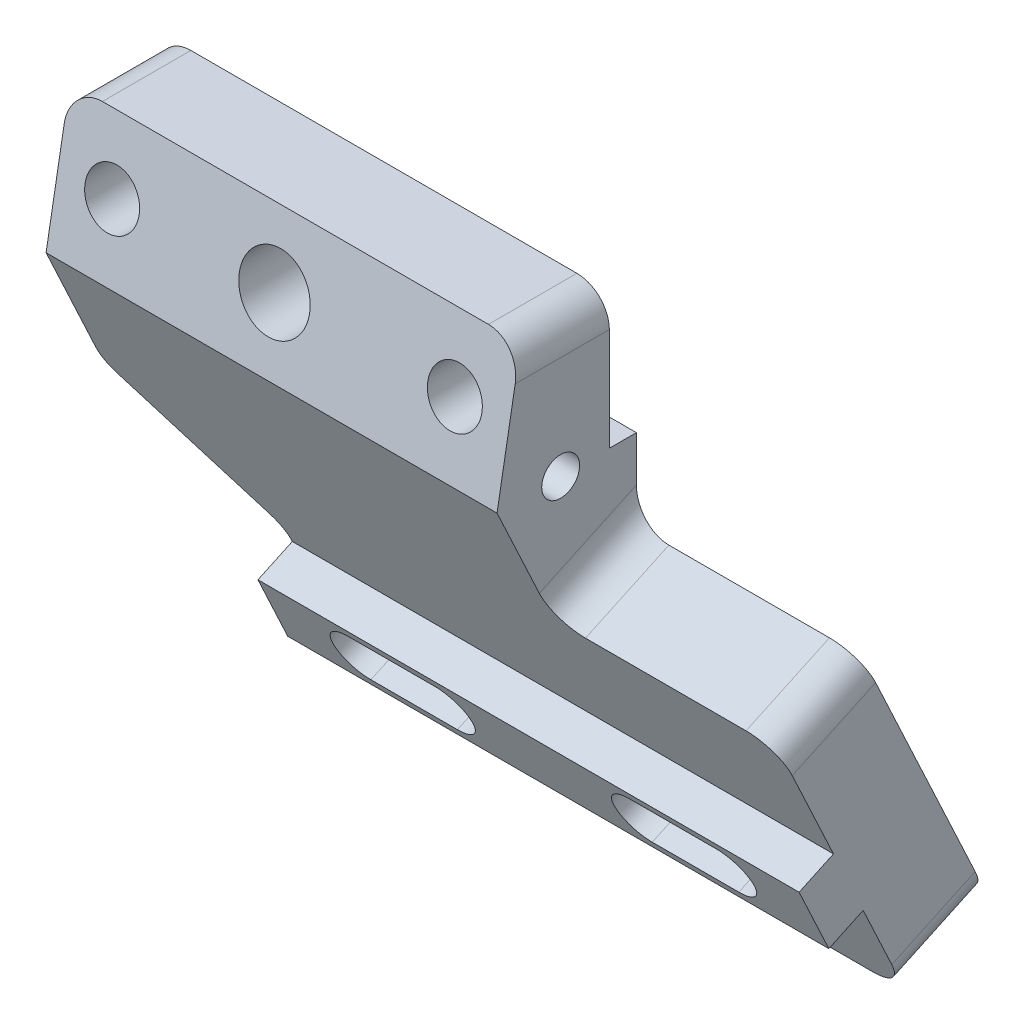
ISO-10303-21;
HEADER;
FILE_DESCRIPTION(('STEP AP214'),'2;1');
FILE_NAME('part.step','',(''),(''),'','','');
FILE_SCHEMA(('AUTOMOTIVE_DESIGN { 1 0 10303 214 1 1 1 1 }'));
ENDSEC;
DATA;
#1=APPLICATION_CONTEXT('core data for automotive mechanical design processes');
#2=APPLICATION_PROTOCOL_DEFINITION('international standard','automotive_design',2000,#1);
#3=PRODUCT_CONTEXT('',#1,'mechanical');
#4=PRODUCT('Part','Part','',(#3));
#5=PRODUCT_RELATED_PRODUCT_CATEGORY('part','',(#4));
#6=PRODUCT_DEFINITION_FORMATION('','',#4);
#7=PRODUCT_DEFINITION_CONTEXT('part definition',#1,'design');
#8=PRODUCT_DEFINITION('design','',#6,#7);
#9=PRODUCT_DEFINITION_SHAPE('','',#8);
#10=(LENGTH_UNIT() NAMED_UNIT(*) SI_UNIT(.MILLI.,.METRE.));
#11=(NAMED_UNIT(*) PLANE_ANGLE_UNIT() SI_UNIT($,.RADIAN.));
#12=(NAMED_UNIT(*) SI_UNIT($,.STERADIAN.) SOLID_ANGLE_UNIT());
#13=UNCERTAINTY_MEASURE_WITH_UNIT(LENGTH_MEASURE(1.E-05),#10,'distance_accuracy_value','');
#14=(GEOMETRIC_REPRESENTATION_CONTEXT(3) GLOBAL_UNCERTAINTY_ASSIGNED_CONTEXT((#13)) GLOBAL_UNIT_ASSIGNED_CONTEXT((#10,
#11,#12)) REPRESENTATION_CONTEXT('',''));
#15=CARTESIAN_POINT('',(0.,0.,0.));
#16=DIRECTION('',(0.,0.,1.));
#17=DIRECTION('',(1.,0.,0.));
#18=AXIS2_PLACEMENT_3D('',#15,#16,#17);
#19=CARTESIAN_POINT('',(125.,-2.02891304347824,17.));
#20=DIRECTION('',(0.,0.422618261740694,-0.906307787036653));
#21=DIRECTION('',(0.,0.906307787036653,0.422618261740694));
#22=AXIS2_PLACEMENT_3D('',#19,#20,#21);
#23=PLANE('',#22);
#24=DIRECTION('',(-1.,0.,0.));
#25=VECTOR('',#24,1.);
#26=CARTESIAN_POINT('',(25.,-45.9848407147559,-3.49698569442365));
#27=LINE('',#26,#25);
#28=CARTESIAN_POINT('',(125.,-45.9848407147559,-3.49698569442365));
#29=VERTEX_POINT('',#28);
#30=CARTESIAN_POINT('',(25.,-45.9848407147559,-3.49698569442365));
#31=VERTEX_POINT('',#30);
#32=EDGE_CURVE('E293',#29,#31,#27,.T.);
#33=ORIENTED_EDGE('',*,*,#32,.F.);
#34=DIRECTION('',(0.,-0.906307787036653,-0.422618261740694));
#35=VECTOR('',#34,1.);
#36=CARTESIAN_POINT('',(125.,-2.02891304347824,17.));
#37=LINE('',#36,#35);
#38=CARTESIAN_POINT('',(125.,-29.6512702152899,4.11948331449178));
#39=VERTEX_POINT('',#38);
#40=EDGE_CURVE('E441',#39,#29,#37,.T.);
#41=ORIENTED_EDGE('',*,*,#40,.F.);
#42=CARTESIAN_POINT('',(119.,-29.6512702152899,4.11948331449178));
#43=DIRECTION('',(0.,0.422618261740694,-0.906307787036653));
#44=DIRECTION('',(0.,0.906307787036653,0.422618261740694));
#45=AXIS2_PLACEMENT_3D('',#42,#43,#44);
#46=CIRCLE('',#45,6.);
#47=CARTESIAN_POINT('',(119.,-24.21342349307,6.65519288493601));
#48=VERTEX_POINT('',#47);
#49=EDGE_CURVE('E514',#39,#48,#46,.F.);
#50=ORIENTED_EDGE('',*,*,#49,.T.);
#51=DIRECTION('',(1.,0.,0.));
#52=VECTOR('',#51,1.);
#53=CARTESIAN_POINT('',(83.3333333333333,-24.21342349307,6.65519288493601));
#54=LINE('',#53,#52);
#55=CARTESIAN_POINT('',(89.3333333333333,-24.21342349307,6.65519288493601));
#56=VERTEX_POINT('',#55);
#57=EDGE_CURVE('E565',#56,#48,#54,.T.);
#58=ORIENTED_EDGE('',*,*,#57,.F.);
#59=CARTESIAN_POINT('',(89.3333333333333,-18.7755767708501,9.19090245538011));
#60=DIRECTION('',(0.,0.422618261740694,-0.906307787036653));
#61=DIRECTION('',(0.,0.906307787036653,0.422618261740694));
#62=AXIS2_PLACEMENT_3D('',#59,#60,#61);
#63=CIRCLE('',#62,6.);
#64=CARTESIAN_POINT('',(83.3333333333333,-18.7755767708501,9.19090245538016));
#65=VERTEX_POINT('',#64);
#66=EDGE_CURVE('E432',#56,#65,#63,.T.);
#67=ORIENTED_EDGE('',*,*,#66,.T.);
#68=DIRECTION('',(0.,-0.906307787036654,-0.422618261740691));
#69=VECTOR('',#68,1.);
#70=CARTESIAN_POINT('',(83.3333333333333,-2.02891304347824,17.));
#71=LINE('',#70,#69);
#72=CARTESIAN_POINT('',(83.3333333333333,-2.02891304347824,17.));
#73=VERTEX_POINT('',#72);
#74=EDGE_CURVE('E562',#73,#65,#71,.T.);
#75=ORIENTED_EDGE('',*,*,#74,.F.);
#76=DIRECTION('',(-1.,0.,0.));
#77=VECTOR('',#76,1.);
#78=CARTESIAN_POINT('',(125.,-2.02891304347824,17.));
#79=LINE('',#78,#77);
#80=CARTESIAN_POINT('',(0.,-2.02891304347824,17.));
#81=VERTEX_POINT('',#80);
#82=EDGE_CURVE('E486',#73,#81,#79,.T.);
#83=ORIENTED_EDGE('',*,*,#82,.T.);
#84=DIRECTION('',(0.,-0.906307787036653,-0.422618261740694));
#85=VECTOR('',#84,1.);
#86=CARTESIAN_POINT('',(0.,-2.02891304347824,17.));
#87=LINE('',#86,#85);
#88=CARTESIAN_POINT('',(0.,-21.6777139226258,7.83761367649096));
#89=VERTEX_POINT('',#88);
#90=EDGE_CURVE('E458',#81,#89,#87,.T.);
#91=ORIENTED_EDGE('',*,*,#90,.T.);
#92=CARTESIAN_POINT('',(6.,-21.6777139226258,7.83761367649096));
#93=DIRECTION('',(0.,0.422618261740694,-0.906307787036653));
#94=DIRECTION('',(0.,0.906307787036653,0.422618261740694));
#95=AXIS2_PLACEMENT_3D('',#92,#93,#94);
#96=CIRCLE('',#95,6.);
#97=CARTESIAN_POINT('',(2.14327434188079,-25.8433461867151,5.89514745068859));
#98=VERTEX_POINT('',#97);
#99=EDGE_CURVE('E512',#89,#98,#96,.F.);
#100=ORIENTED_EDGE('',*,*,#99,.T.);
#101=DIRECTION('',(-0.766044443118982,0.582563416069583,0.271653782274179));
#102=VECTOR('',#101,1.);
#103=CARTESIAN_POINT('',(0.,-24.21342349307,6.65519288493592));
#104=LINE('',#103,#102);
#105=CARTESIAN_POINT('',(22.8567256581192,-41.5955640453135,-1.45023236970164));
#106=VERTEX_POINT('',#105);
#107=EDGE_CURVE('E450',#106,#98,#104,.T.);
#108=ORIENTED_EDGE('',*,*,#107,.F.);
#109=CARTESIAN_POINT('',(19.,-45.7611963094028,-3.39269859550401));
#110=DIRECTION('',(0.,0.422618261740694,-0.906307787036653));
#111=DIRECTION('',(0.,0.906307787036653,0.422618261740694));
#112=AXIS2_PLACEMENT_3D('',#109,#110,#111);
#113=CIRCLE('',#112,6.);
#114=CARTESIAN_POINT('',(25.,-45.7611963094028,-3.39269859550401));
#115=VERTEX_POINT('',#114);
#116=EDGE_CURVE('E337',#106,#115,#113,.T.);
#117=ORIENTED_EDGE('',*,*,#116,.T.);
#118=DIRECTION('',(0.,0.906307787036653,0.422618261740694));
#119=VECTOR('',#118,1.);
#120=CARTESIAN_POINT('',(25.,-43.2254867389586,-2.21027780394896));
#121=LINE('',#120,#119);
#122=EDGE_CURVE('E308',#31,#115,#121,.T.);
#123=ORIENTED_EDGE('',*,*,#122,.F.);
#124=EDGE_LOOP('',(#33,#41,#50,#58,#67,#75,#83,#91,#100,#108,#117,#123));
#125=FACE_BOUND('',#124,.T.);
#126=ADVANCED_FACE('F34',(#125),#23,.F.);
#127=DIRECTION('',(1.,0.,0.));
#128=VECTOR('',#127,1.);
#129=CARTESIAN_POINT('',(25.,-57.7668419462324,-8.99102309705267));
#130=LINE('',#129,#128);
#131=CARTESIAN_POINT('',(25.,-57.7668419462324,-8.99102309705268));
#132=VERTEX_POINT('',#131);
#133=CARTESIAN_POINT('',(125.,-57.7668419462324,-8.99102309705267));
#134=VERTEX_POINT('',#133);
#135=EDGE_CURVE('E282',#132,#134,#130,.T.);
#136=ORIENTED_EDGE('',*,*,#135,.F.);
#137=CARTESIAN_POINT('',(25.,-69.0956892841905,-14.2737513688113));
#138=VERTEX_POINT('',#137);
#139=EDGE_CURVE('E592',#138,#132,#121,.T.);
#140=ORIENTED_EDGE('',*,*,#139,.F.);
#141=CARTESIAN_POINT('',(31.,-69.0956892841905,-14.2737513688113));
#142=DIRECTION('',(0.,0.422618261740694,-0.906307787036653));
#143=DIRECTION('',(0.,0.906307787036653,0.422618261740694));
#144=AXIS2_PLACEMENT_3D('',#141,#142,#143);
#145=CIRCLE('',#144,6.);
#146=CARTESIAN_POINT('',(31.,-74.5335360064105,-16.8094609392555));
#147=VERTEX_POINT('',#146);
#148=EDGE_CURVE('E510',#138,#147,#145,.F.);
#149=ORIENTED_EDGE('',*,*,#148,.T.);
#150=DIRECTION('',(-1.,0.,0.));
#151=VECTOR('',#150,1.);
#152=CARTESIAN_POINT('',(125.,-74.5335360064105,-16.8094609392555));
#153=LINE('',#152,#151);
#154=CARTESIAN_POINT('',(119.,-74.5335360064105,-16.8094609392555));
#155=VERTEX_POINT('',#154);
#156=EDGE_CURVE('E483',#155,#147,#153,.T.);
#157=ORIENTED_EDGE('',*,*,#156,.F.);
#158=CARTESIAN_POINT('',(119.,-69.0956892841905,-14.2737513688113));
#159=DIRECTION('',(0.,0.422618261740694,-0.906307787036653));
#160=DIRECTION('',(0.,0.906307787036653,0.422618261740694));
#161=AXIS2_PLACEMENT_3D('',#158,#159,#160);
#162=CIRCLE('',#161,6.);
#163=CARTESIAN_POINT('',(125.,-69.0956892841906,-14.2737513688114));
#164=VERTEX_POINT('',#163);
#165=EDGE_CURVE('E516',#155,#164,#162,.F.);
#166=ORIENTED_EDGE('',*,*,#165,.T.);
#167=EDGE_CURVE('E446',#134,#164,#37,.T.);
#168=ORIENTED_EDGE('',*,*,#167,.F.);
#169=EDGE_LOOP('',(#136,#140,#149,#157,#166,#168));
#170=FACE_BOUND('',#169,.T.);
#171=ADVANCED_FACE('F370',(#170),#23,.F.);
#172=CARTESIAN_POINT('',(125.,22.9710869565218,-3.75203949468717));
#173=DIRECTION('',(0.,-1.,0.));
#174=DIRECTION('',(0.,0.,-1.));
#175=AXIS2_PLACEMENT_3D('',#172,#173,#174);
#176=PLANE('',#175);
#177=DIRECTION('',(-1.,0.,0.));
#178=VECTOR('',#177,1.);
#179=CARTESIAN_POINT('',(125.,22.9710869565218,12.5918254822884));
#180=LINE('',#179,#178);
#181=CARTESIAN_POINT('',(77.3333333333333,22.9710869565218,12.5918254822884));
#182=VERTEX_POINT('',#181);
#183=CARTESIAN_POINT('',(6.00000000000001,22.9710869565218,12.5918254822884));
#184=VERTEX_POINT('',#183);
#185=EDGE_CURVE('E489',#182,#184,#180,.T.);
#186=ORIENTED_EDGE('',*,*,#185,.F.);
#187=DIRECTION('',(0.,0.,1.));
#188=VECTOR('',#187,1.);
#189=CARTESIAN_POINT('',(77.3333333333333,22.9710869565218,-3.75203949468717));
#190=LINE('',#189,#188);
#191=CARTESIAN_POINT('',(77.3333333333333,22.9710869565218,-3.75203949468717));
#192=VERTEX_POINT('',#191);
#193=EDGE_CURVE('E537',#182,#192,#190,.F.);
#194=ORIENTED_EDGE('',*,*,#193,.T.);
#195=DIRECTION('',(-1.,0.,0.));
#196=VECTOR('',#195,1.);
#197=CARTESIAN_POINT('',(125.,22.9710869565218,-3.75203949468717));
#198=LINE('',#197,#196);
#199=CARTESIAN_POINT('',(6.00000000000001,22.9710869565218,-3.75203949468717));
#200=VERTEX_POINT('',#199);
#201=EDGE_CURVE('E455',#192,#200,#198,.T.);
#202=ORIENTED_EDGE('',*,*,#201,.T.);
#203=DIRECTION('',(0.,0.,1.));
#204=VECTOR('',#203,1.);
#205=CARTESIAN_POINT('',(6.00000000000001,22.9710869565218,-3.75203949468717));
#206=LINE('',#205,#204);
#207=EDGE_CURVE('E534',#200,#184,#206,.T.);
#208=ORIENTED_EDGE('',*,*,#207,.T.);
#209=EDGE_LOOP('',(#186,#194,#202,#208));
#210=FACE_BOUND('',#209,.T.);
#211=ADVANCED_FACE('F376',(#210),#176,.F.);
#212=CARTESIAN_POINT('',(125.,22.9710869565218,12.5918254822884));
#213=DIRECTION('',(0.,-0.173648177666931,-0.984807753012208));
#214=DIRECTION('',(0.,0.984807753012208,-0.173648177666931));
#215=AXIS2_PLACEMENT_3D('',#212,#213,#214);
#216=PLANE('',#215);
#217=CARTESIAN_POINT('',(73.3333333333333,10.4710869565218,14.7959127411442));
#218=DIRECTION('',(0.,-0.173648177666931,-0.984807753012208));
#219=DIRECTION('',(0.,0.984807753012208,-0.173648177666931));
#220=AXIS2_PLACEMENT_3D('',#217,#218,#219);
#221=ELLIPSE('',#220,5.07713305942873,5.);
#222=CARTESIAN_POINT('',(73.3333333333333,15.4710869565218,13.9142778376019));
#223=VERTEX_POINT('',#222);
#224=EDGE_CURVE('E941',#223,#223,#221,.T.);
#225=ORIENTED_EDGE('',*,*,#224,.T.);
#226=EDGE_LOOP('',(#225));
#227=FACE_BOUND('',#226,.T.);
#228=CARTESIAN_POINT('',(10.,10.4710869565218,14.7959127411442));
#229=DIRECTION('',(0.,-0.173648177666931,-0.984807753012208));
#230=DIRECTION('',(0.,0.984807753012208,-0.173648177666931));
#231=AXIS2_PLACEMENT_3D('',#228,#229,#230);
#232=ELLIPSE('',#231,5.07713305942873,5.);
#233=CARTESIAN_POINT('',(10.,15.4710869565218,13.9142778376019));
#234=VERTEX_POINT('',#233);
#235=EDGE_CURVE('E945',#234,#234,#232,.T.);
#236=ORIENTED_EDGE('',*,*,#235,.T.);
#237=EDGE_LOOP('',(#236));
#238=FACE_BOUND('',#237,.T.);
#239=CARTESIAN_POINT('',(40.,10.4710869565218,14.7959127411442));
#240=DIRECTION('',(0.,-0.173648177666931,-0.984807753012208));
#241=DIRECTION('',(0.,0.984807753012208,-0.173648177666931));
#242=AXIS2_PLACEMENT_3D('',#239,#240,#241);
#243=ELLIPSE('',#242,6.60027297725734,6.5);
#244=CARTESIAN_POINT('',(40.,16.9710869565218,13.6497873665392));
#245=VERTEX_POINT('',#244);
#246=EDGE_CURVE('E952',#245,#245,#243,.T.);
#247=ORIENTED_EDGE('',*,*,#246,.T.);
#248=EDGE_LOOP('',(#247));
#249=FACE_BOUND('',#248,.T.);
#250=DIRECTION('',(0.,-0.984807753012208,0.173648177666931));
#251=VECTOR('',#250,1.);
#252=CARTESIAN_POINT('',(83.3333333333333,22.9710869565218,12.5918254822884));
#253=LINE('',#252,#251);
#254=CARTESIAN_POINT('',(83.3333333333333,16.9710869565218,13.6497873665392));
#255=VERTEX_POINT('',#254);
#256=EDGE_CURVE('E571',#255,#73,#253,.T.);
#257=ORIENTED_EDGE('',*,*,#256,.F.);
#258=CARTESIAN_POINT('',(77.3333333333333,16.9710869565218,13.6497873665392));
#259=DIRECTION('',(0.,-0.173648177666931,-0.984807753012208));
#260=DIRECTION('',(0.,0.984807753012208,-0.173648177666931));
#261=AXIS2_PLACEMENT_3D('',#258,#259,#260);
#262=ELLIPSE('',#261,6.09255967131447,6.);
#263=EDGE_CURVE('E532',#255,#182,#262,.F.);
#264=ORIENTED_EDGE('',*,*,#263,.T.);
#265=ORIENTED_EDGE('',*,*,#185,.T.);
#266=CARTESIAN_POINT('',(6.00000000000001,16.9710869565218,13.6497873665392));
#267=DIRECTION('',(0.,-0.173648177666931,-0.984807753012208));
#268=DIRECTION('',(0.,-0.984807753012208,0.173648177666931));
#269=AXIS2_PLACEMENT_3D('',#266,#267,#268);
#270=ELLIPSE('',#269,6.09255967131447,6.);
#271=CARTESIAN_POINT('',(0.,16.9710869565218,13.6497873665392));
#272=VERTEX_POINT('',#271);
#273=EDGE_CURVE('E530',#184,#272,#270,.F.);
#274=ORIENTED_EDGE('',*,*,#273,.T.);
#275=DIRECTION('',(0.,-0.984807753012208,0.173648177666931));
#276=VECTOR('',#275,1.);
#277=CARTESIAN_POINT('',(0.,22.9710869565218,12.5918254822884));
#278=LINE('',#277,#276);
#279=EDGE_CURVE('E456',#272,#81,#278,.T.);
#280=ORIENTED_EDGE('',*,*,#279,.T.);
#281=ORIENTED_EDGE('',*,*,#82,.F.);
#282=EDGE_LOOP('',(#257,#264,#265,#274,#280,#281));
#283=FACE_BOUND('',#282,.T.);
#284=ADVANCED_FACE('F382',(#227,#238,#249,#283),#216,.F.);
#285=CARTESIAN_POINT('',(125.,-2.02891304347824,-8.75203949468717));
#286=DIRECTION('',(0.,0.,1.));
#287=DIRECTION('',(1.,0.,0.));
#288=AXIS2_PLACEMENT_3D('',#285,#286,#287);
#289=PLANE('',#288);
#290=DIRECTION('',(-1.,0.,0.));
#291=VECTOR('',#290,1.);
#292=CARTESIAN_POINT('',(125.,-17.0289130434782,-8.75203949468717));
#293=LINE('',#292,#291);
#294=CARTESIAN_POINT('',(89.3333333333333,-17.0289130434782,-8.75203949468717));
#295=VERTEX_POINT('',#294);
#296=CARTESIAN_POINT('',(0.692264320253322,-17.0289130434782,-8.75203949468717));
#297=VERTEX_POINT('',#296);
#298=EDGE_CURVE('E476',#295,#297,#293,.T.);
#299=ORIENTED_EDGE('',*,*,#298,.T.);
#300=CARTESIAN_POINT('',(6.,-13.9418316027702,-8.75203949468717));
#301=DIRECTION('',(0.,0.,1.));
#302=DIRECTION('',(0.,1.,0.));
#303=AXIS2_PLACEMENT_3D('',#300,#301,#302);
#304=ELLIPSE('',#303,6.62026751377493,6.);
#305=CARTESIAN_POINT('',(0.,-13.9418316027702,-8.75203949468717));
#306=VERTEX_POINT('',#305);
#307=EDGE_CURVE('E551',#297,#306,#304,.F.);
#308=ORIENTED_EDGE('',*,*,#307,.T.);
#309=DIRECTION('',(0.,1.,0.));
#310=VECTOR('',#309,1.);
#311=CARTESIAN_POINT('',(0.,-2.02891304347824,-8.75203949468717));
#312=LINE('',#311,#310);
#313=CARTESIAN_POINT('',(0.,-2.02891304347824,-8.75203949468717));
#314=VERTEX_POINT('',#313);
#315=EDGE_CURVE('E461',#306,#314,#312,.T.);
#316=ORIENTED_EDGE('',*,*,#315,.T.);
#317=DIRECTION('',(-1.,0.,0.));
#318=VECTOR('',#317,1.);
#319=CARTESIAN_POINT('',(125.,-2.02891304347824,-8.75203949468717));
#320=LINE('',#319,#318);
#321=CARTESIAN_POINT('',(83.3333333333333,-2.02891304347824,-8.75203949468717));
#322=VERTEX_POINT('',#321);
#323=EDGE_CURVE('E473',#322,#314,#320,.T.);
#324=ORIENTED_EDGE('',*,*,#323,.F.);
#325=DIRECTION('',(0.,1.,0.));
#326=VECTOR('',#325,1.);
#327=CARTESIAN_POINT('',(83.3333333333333,-17.0289130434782,-8.75203949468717));
#328=LINE('',#327,#326);
#329=CARTESIAN_POINT('',(83.3333333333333,-10.4086455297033,-8.75203949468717));
#330=VERTEX_POINT('',#329);
#331=EDGE_CURVE('E439',#330,#322,#328,.T.);
#332=ORIENTED_EDGE('',*,*,#331,.F.);
#333=CARTESIAN_POINT('',(89.3333333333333,-10.4086455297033,-8.75203949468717));
#334=DIRECTION('',(0.,0.,1.));
#335=DIRECTION('',(0.,1.,0.));
#336=AXIS2_PLACEMENT_3D('',#333,#334,#335);
#337=ELLIPSE('',#336,6.62026751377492,6.);
#338=EDGE_CURVE('E556',#330,#295,#337,.T.);
#339=ORIENTED_EDGE('',*,*,#338,.T.);
#340=EDGE_LOOP('',(#299,#308,#316,#324,#332,#339));
#341=FACE_BOUND('',#340,.T.);
#342=ADVANCED_FACE('F385',(#341),#289,.F.);
#343=CARTESIAN_POINT('',(125.,-2.02891304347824,-3.75203949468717));
#344=DIRECTION('',(0.,-1.,0.));
#345=DIRECTION('',(0.,0.,-1.));
#346=AXIS2_PLACEMENT_3D('',#343,#344,#345);
#347=PLANE('',#346);
#348=DIRECTION('',(0.,0.,1.));
#349=VECTOR('',#348,1.);
#350=CARTESIAN_POINT('',(83.3333333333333,-2.02891304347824,-8.75203949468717));
#351=LINE('',#350,#349);
#352=CARTESIAN_POINT('',(83.3333333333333,-2.02891304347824,-3.75203949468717));
#353=VERTEX_POINT('',#352);
#354=EDGE_CURVE('E578',#322,#353,#351,.T.);
#355=ORIENTED_EDGE('',*,*,#354,.F.);
#356=ORIENTED_EDGE('',*,*,#323,.T.);
#357=DIRECTION('',(0.,0.,1.));
#358=VECTOR('',#357,1.);
#359=CARTESIAN_POINT('',(0.,-2.02891304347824,-3.75203949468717));
#360=LINE('',#359,#358);
#361=CARTESIAN_POINT('',(0.,-2.02891304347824,-3.75203949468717));
#362=VERTEX_POINT('',#361);
#363=EDGE_CURVE('E463',#314,#362,#360,.T.);
#364=ORIENTED_EDGE('',*,*,#363,.T.);
#365=DIRECTION('',(-1.,0.,0.));
#366=VECTOR('',#365,1.);
#367=CARTESIAN_POINT('',(125.,-2.02891304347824,-3.75203949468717));
#368=LINE('',#367,#366);
#369=EDGE_CURVE('E471',#353,#362,#368,.T.);
#370=ORIENTED_EDGE('',*,*,#369,.F.);
#371=EDGE_LOOP('',(#355,#356,#364,#370));
#372=FACE_BOUND('',#371,.T.);
#373=ADVANCED_FACE('F631',(#372),#347,.F.);
#374=CARTESIAN_POINT('',(125.,-2.02891304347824,-3.75203949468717));
#375=DIRECTION('',(0.,0.,1.));
#376=DIRECTION('',(1.,0.,0.));
#377=AXIS2_PLACEMENT_3D('',#374,#375,#376);
#378=PLANE('',#377);
#379=CARTESIAN_POINT('',(73.3333333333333,10.4710869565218,-3.75203949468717));
#380=DIRECTION('',(0.,0.,-1.));
#381=DIRECTION('',(-1.,0.,0.));
#382=AXIS2_PLACEMENT_3D('',#379,#380,#381);
#383=CIRCLE('',#382,5.);
#384=CARTESIAN_POINT('',(68.3333333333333,10.4710869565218,-3.75203949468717));
#385=VERTEX_POINT('',#384);
#386=EDGE_CURVE('E320',#385,#385,#383,.T.);
#387=ORIENTED_EDGE('',*,*,#386,.F.);
#388=EDGE_LOOP('',(#387));
#389=FACE_BOUND('',#388,.T.);
#390=CARTESIAN_POINT('',(10.,10.4710869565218,-3.75203949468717));
#391=DIRECTION('',(0.,0.,-1.));
#392=DIRECTION('',(-1.,0.,0.));
#393=AXIS2_PLACEMENT_3D('',#390,#391,#392);
#394=CIRCLE('',#393,5.);
#395=CARTESIAN_POINT('',(5.,10.4710869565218,-3.75203949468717));
#396=VERTEX_POINT('',#395);
#397=EDGE_CURVE('E942',#396,#396,#394,.T.);
#398=ORIENTED_EDGE('',*,*,#397,.F.);
#399=EDGE_LOOP('',(#398));
#400=FACE_BOUND('',#399,.T.);
#401=CARTESIAN_POINT('',(40.,10.4710869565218,-3.75203949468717));
#402=DIRECTION('',(0.,0.,-1.));
#403=DIRECTION('',(-1.,0.,0.));
#404=AXIS2_PLACEMENT_3D('',#401,#402,#403);
#405=CIRCLE('',#404,6.5);
#406=CARTESIAN_POINT('',(33.5,10.4710869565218,-3.75203949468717));
#407=VERTEX_POINT('',#406);
#408=EDGE_CURVE('E950',#407,#407,#405,.T.);
#409=ORIENTED_EDGE('',*,*,#408,.F.);
#410=EDGE_LOOP('',(#409));
#411=FACE_BOUND('',#410,.T.);
#412=ORIENTED_EDGE('',*,*,#201,.F.);
#413=CARTESIAN_POINT('',(77.3333333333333,16.9710869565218,-3.75203949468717));
#414=DIRECTION('',(0.,0.,1.));
#415=DIRECTION('',(1.,0.,0.));
#416=AXIS2_PLACEMENT_3D('',#413,#414,#415);
#417=CIRCLE('',#416,6.);
#418=CARTESIAN_POINT('',(83.3333333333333,16.9710869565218,-3.75203949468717));
#419=VERTEX_POINT('',#418);
#420=EDGE_CURVE('E541',#192,#419,#417,.F.);
#421=ORIENTED_EDGE('',*,*,#420,.T.);
#422=DIRECTION('',(0.,1.,0.));
#423=VECTOR('',#422,1.);
#424=CARTESIAN_POINT('',(83.3333333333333,-2.02891304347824,-3.75203949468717));
#425=LINE('',#424,#423);
#426=EDGE_CURVE('E580',#353,#419,#425,.T.);
#427=ORIENTED_EDGE('',*,*,#426,.F.);
#428=ORIENTED_EDGE('',*,*,#369,.T.);
#429=DIRECTION('',(0.,1.,0.));
#430=VECTOR('',#429,1.);
#431=CARTESIAN_POINT('',(0.,-2.02891304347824,-3.75203949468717));
#432=LINE('',#431,#430);
#433=CARTESIAN_POINT('',(0.,16.9710869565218,-3.75203949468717));
#434=VERTEX_POINT('',#433);
#435=EDGE_CURVE('E466',#362,#434,#432,.T.);
#436=ORIENTED_EDGE('',*,*,#435,.T.);
#437=CARTESIAN_POINT('',(6.00000000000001,16.9710869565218,-3.75203949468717));
#438=DIRECTION('',(0.,0.,1.));
#439=DIRECTION('',(1.,0.,0.));
#440=AXIS2_PLACEMENT_3D('',#437,#438,#439);
#441=CIRCLE('',#440,6.);
#442=EDGE_CURVE('E539',#434,#200,#441,.F.);
#443=ORIENTED_EDGE('',*,*,#442,.T.);
#444=EDGE_LOOP('',(#412,#421,#427,#428,#436,#443));
#445=FACE_BOUND('',#444,.T.);
#446=ADVANCED_FACE('F628',(#389,#400,#411,#445),#378,.F.);
#447=CARTESIAN_POINT('',(125.,-74.5335360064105,-16.8094609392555));
#448=DIRECTION('',(0.,0.906307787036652,0.422618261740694));
#449=DIRECTION('',(0.,-0.422618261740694,0.906307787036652));
#450=AXIS2_PLACEMENT_3D('',#447,#448,#449);
#451=PLANE('',#450);
#452=DIRECTION('',(-1.,0.,0.));
#453=VECTOR('',#452,1.);
#454=CARTESIAN_POINT('',(125.,-67.3490255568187,-32.2166933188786));
#455=LINE('',#454,#453);
#456=CARTESIAN_POINT('',(119.,-67.3490255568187,-32.2166933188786));
#457=VERTEX_POINT('',#456);
#458=CARTESIAN_POINT('',(31.,-67.3490255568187,-32.2166933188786));
#459=VERTEX_POINT('',#458);
#460=EDGE_CURVE('E480',#457,#459,#455,.T.);
#461=ORIENTED_EDGE('',*,*,#460,.F.);
#462=DIRECTION('',(0.,0.422618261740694,-0.906307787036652));
#463=VECTOR('',#462,1.);
#464=CARTESIAN_POINT('',(119.,-74.5335360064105,-16.8094609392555));
#465=LINE('',#464,#463);
#466=EDGE_CURVE('E508',#457,#155,#465,.F.);
#467=ORIENTED_EDGE('',*,*,#466,.T.);
#468=ORIENTED_EDGE('',*,*,#156,.T.);
#469=DIRECTION('',(0.,0.422618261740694,-0.906307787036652));
#470=VECTOR('',#469,1.);
#471=CARTESIAN_POINT('',(31.,-74.5335360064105,-16.8094609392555));
#472=LINE('',#471,#470);
#473=EDGE_CURVE('E505',#147,#459,#472,.T.);
#474=ORIENTED_EDGE('',*,*,#473,.T.);
#475=EDGE_LOOP('',(#461,#467,#468,#474));
#476=FACE_BOUND('',#475,.T.);
#477=ADVANCED_FACE('F380',(#476),#451,.F.);
#478=CARTESIAN_POINT('',(125.,-17.0289130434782,-8.75203949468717));
#479=DIRECTION('',(0.,-0.422618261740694,0.906307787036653));
#480=DIRECTION('',(0.,-0.906307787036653,-0.422618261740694));
#481=AXIS2_PLACEMENT_3D('',#478,#479,#480);
#482=PLANE('',#481);
#483=DIRECTION('',(-1.,0.,0.));
#484=VECTOR('',#483,1.);
#485=CARTESIAN_POINT('',(57.,-49.2228698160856,-23.7643280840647));
#486=LINE('',#485,#484);
#487=CARTESIAN_POINT('',(57.,-49.2228698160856,-23.7643280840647));
#488=VERTEX_POINT('',#487);
#489=CARTESIAN_POINT('',(41.,-49.2228698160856,-23.7643280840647));
#490=VERTEX_POINT('',#489);
#491=EDGE_CURVE('E252',#488,#490,#486,.T.);
#492=ORIENTED_EDGE('',*,*,#491,.F.);
#493=CARTESIAN_POINT('',(57.,-44.6913308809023,-21.6512367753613));
#494=DIRECTION('',(0.,0.422618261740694,-0.906307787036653));
#495=DIRECTION('',(0.,-0.906307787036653,-0.422618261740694));
#496=AXIS2_PLACEMENT_3D('',#493,#494,#495);
#497=CIRCLE('',#496,5.);
#498=CARTESIAN_POINT('',(57.,-40.1597919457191,-19.5381454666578));
#499=VERTEX_POINT('',#498);
#500=EDGE_CURVE('E49',#499,#488,#497,.T.);
#501=ORIENTED_EDGE('',*,*,#500,.F.);
#502=DIRECTION('',(1.,0.,0.));
#503=VECTOR('',#502,1.);
#504=CARTESIAN_POINT('',(57.,-40.1597919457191,-19.5381454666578));
#505=LINE('',#504,#503);
#506=CARTESIAN_POINT('',(41.,-40.1597919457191,-19.5381454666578));
#507=VERTEX_POINT('',#506);
#508=EDGE_CURVE('E259',#507,#499,#505,.T.);
#509=ORIENTED_EDGE('',*,*,#508,.F.);
#510=CARTESIAN_POINT('',(41.,-44.6913308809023,-21.6512367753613));
#511=DIRECTION('',(0.,0.422618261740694,-0.906307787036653));
#512=DIRECTION('',(0.,0.906307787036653,0.422618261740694));
#513=AXIS2_PLACEMENT_3D('',#510,#511,#512);
#514=CIRCLE('',#513,5.);
#515=EDGE_CURVE('E243',#490,#507,#514,.T.);
#516=ORIENTED_EDGE('',*,*,#515,.F.);
#517=EDGE_LOOP('',(#492,#501,#509,#516));
#518=FACE_BOUND('',#517,.T.);
#519=DIRECTION('',(-1.,0.,0.));
#520=VECTOR('',#519,1.);
#521=CARTESIAN_POINT('',(109.,-49.2228698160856,-23.7643280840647));
#522=LINE('',#521,#520);
#523=CARTESIAN_POINT('',(109.,-49.2228698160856,-23.7643280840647));
#524=VERTEX_POINT('',#523);
#525=CARTESIAN_POINT('',(93.,-49.2228698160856,-23.7643280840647));
#526=VERTEX_POINT('',#525);
#527=EDGE_CURVE('E270',#524,#526,#522,.T.);
#528=ORIENTED_EDGE('',*,*,#527,.F.);
#529=CARTESIAN_POINT('',(109.,-44.6913308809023,-21.6512367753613));
#530=DIRECTION('',(0.,0.422618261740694,-0.906307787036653));
#531=DIRECTION('',(0.,-0.906307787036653,-0.422618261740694));
#532=AXIS2_PLACEMENT_3D('',#529,#530,#531);
#533=CIRCLE('',#532,5.);
#534=CARTESIAN_POINT('',(109.,-40.1597919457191,-19.5381454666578));
#535=VERTEX_POINT('',#534);
#536=EDGE_CURVE('E266',#535,#524,#533,.T.);
#537=ORIENTED_EDGE('',*,*,#536,.F.);
#538=DIRECTION('',(1.,0.,0.));
#539=VECTOR('',#538,1.);
#540=CARTESIAN_POINT('',(109.,-40.1597919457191,-19.5381454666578));
#541=LINE('',#540,#539);
#542=CARTESIAN_POINT('',(93.,-40.1597919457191,-19.5381454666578));
#543=VERTEX_POINT('',#542);
#544=EDGE_CURVE('E276',#543,#535,#541,.T.);
#545=ORIENTED_EDGE('',*,*,#544,.F.);
#546=CARTESIAN_POINT('',(93.,-44.6913308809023,-21.6512367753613));
#547=DIRECTION('',(0.,0.422618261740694,-0.906307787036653));
#548=DIRECTION('',(0.,0.906307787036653,0.422618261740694));
#549=AXIS2_PLACEMENT_3D('',#546,#547,#548);
#550=CIRCLE('',#549,5.);
#551=EDGE_CURVE('E273',#526,#543,#550,.T.);
#552=ORIENTED_EDGE('',*,*,#551,.F.);
#553=EDGE_LOOP('',(#528,#537,#545,#552));
#554=FACE_BOUND('',#553,.T.);
#555=DIRECTION('',(0.,0.906307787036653,0.422618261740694));
#556=VECTOR('',#555,1.);
#557=CARTESIAN_POINT('',(125.,-17.0289130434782,-8.75203949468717));
#558=LINE('',#557,#556);
#559=CARTESIAN_POINT('',(125.,-61.9111788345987,-29.6809837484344));
#560=VERTEX_POINT('',#559);
#561=CARTESIAN_POINT('',(125.,-22.4667597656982,-11.2877490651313));
#562=VERTEX_POINT('',#561);
#563=EDGE_CURVE('E445',#560,#562,#558,.T.);
#564=ORIENTED_EDGE('',*,*,#563,.F.);
#565=CARTESIAN_POINT('',(119.,-61.9111788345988,-29.6809837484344));
#566=DIRECTION('',(0.,-0.422618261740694,0.906307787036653));
#567=DIRECTION('',(0.,-0.906307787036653,-0.422618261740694));
#568=AXIS2_PLACEMENT_3D('',#565,#566,#567);
#569=CIRCLE('',#568,6.);
#570=EDGE_CURVE('E503',#560,#457,#569,.F.);
#571=ORIENTED_EDGE('',*,*,#570,.T.);
#572=ORIENTED_EDGE('',*,*,#460,.T.);
#573=CARTESIAN_POINT('',(31.,-61.9111788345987,-29.6809837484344));
#574=DIRECTION('',(0.,-0.422618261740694,0.906307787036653));
#575=DIRECTION('',(0.,-0.906307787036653,-0.422618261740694));
#576=AXIS2_PLACEMENT_3D('',#573,#574,#575);
#577=CIRCLE('',#576,6.);
#578=CARTESIAN_POINT('',(25.,-61.9111788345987,-29.6809837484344));
#579=VERTEX_POINT('',#578);
#580=EDGE_CURVE('E497',#459,#579,#577,.F.);
#581=ORIENTED_EDGE('',*,*,#580,.T.);
#582=DIRECTION('',(0.,-0.906307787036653,-0.422618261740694));
#583=VECTOR('',#582,1.);
#584=CARTESIAN_POINT('',(25.,-36.0409762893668,-17.6175101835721));
#585=LINE('',#584,#583);
#586=CARTESIAN_POINT('',(25.,-38.5766858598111,-18.7999309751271));
#587=VERTEX_POINT('',#586);
#588=EDGE_CURVE('E598',#587,#579,#585,.T.);
#589=ORIENTED_EDGE('',*,*,#588,.F.);
#590=CARTESIAN_POINT('',(19.,-38.5766858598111,-18.7999309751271));
#591=DIRECTION('',(0.,-0.422618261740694,0.906307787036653));
#592=DIRECTION('',(0.,-0.906307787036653,-0.422618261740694));
#593=AXIS2_PLACEMENT_3D('',#590,#591,#592);
#594=CIRCLE('',#593,6.);
#595=CARTESIAN_POINT('',(22.8567256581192,-34.4110535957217,-16.8574647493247));
#596=VERTEX_POINT('',#595);
#597=EDGE_CURVE('E430',#587,#596,#594,.T.);
#598=ORIENTED_EDGE('',*,*,#597,.T.);
#599=DIRECTION('',(0.766044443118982,-0.582563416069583,-0.271653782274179));
#600=VECTOR('',#599,1.);
#601=CARTESIAN_POINT('',(0.,-17.0289130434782,-8.75203949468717));
#602=LINE('',#601,#600);
#603=CARTESIAN_POINT('',(2.14327434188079,-18.6588357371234,-9.5120849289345));
#604=VERTEX_POINT('',#603);
#605=EDGE_CURVE('E588',#604,#596,#602,.T.);
#606=ORIENTED_EDGE('',*,*,#605,.F.);
#607=CARTESIAN_POINT('',(6.,-14.493203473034,-7.56961870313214));
#608=DIRECTION('',(0.,-0.422618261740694,0.906307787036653));
#609=DIRECTION('',(0.,-0.906307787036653,-0.422618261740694));
#610=AXIS2_PLACEMENT_3D('',#607,#608,#609);
#611=CIRCLE('',#610,6.);
#612=EDGE_CURVE('E499',#604,#297,#611,.F.);
#613=ORIENTED_EDGE('',*,*,#612,.T.);
#614=ORIENTED_EDGE('',*,*,#298,.F.);
#615=CARTESIAN_POINT('',(119.,-17.0289130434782,-8.75203949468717));
#616=VERTEX_POINT('',#615);
#617=EDGE_CURVE('E477',#616,#295,#293,.T.);
#618=ORIENTED_EDGE('',*,*,#617,.F.);
#619=CARTESIAN_POINT('',(119.,-22.4667597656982,-11.2877490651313));
#620=DIRECTION('',(0.,-0.422618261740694,0.906307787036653));
#621=DIRECTION('',(0.,-0.906307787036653,-0.422618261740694));
#622=AXIS2_PLACEMENT_3D('',#619,#620,#621);
#623=CIRCLE('',#622,6.);
#624=EDGE_CURVE('E501',#616,#562,#623,.F.);
#625=ORIENTED_EDGE('',*,*,#624,.T.);
#626=EDGE_LOOP('',(#564,#571,#572,#581,#589,#598,#606,#613,#614,#618,#625));
#627=FACE_BOUND('',#626,.T.);
#628=ADVANCED_FACE('F256',(#518,#554,#627),#482,.F.);
#629=CARTESIAN_POINT('',(125.,22.9710869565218,-8.75203949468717));
#630=DIRECTION('',(1.,0.,0.));
#631=DIRECTION('',(0.,0.,-1.));
#632=AXIS2_PLACEMENT_3D('',#629,#630,#631);
#633=PLANE('',#632);
#634=ORIENTED_EDGE('',*,*,#40,.T.);
#635=DIRECTION('',(0.,0.422618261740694,-0.906307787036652));
#636=VECTOR('',#635,1.);
#637=CARTESIAN_POINT('',(125.,-48.9431685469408,2.84716881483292));
#638=LINE('',#637,#636);
#639=CARTESIAN_POINT('',(125.,-48.9431685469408,2.84716881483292));
#640=VERTEX_POINT('',#639);
#641=EDGE_CURVE('E315',#640,#29,#638,.T.);
#642=ORIENTED_EDGE('',*,*,#641,.F.);
#643=DIRECTION('',(0.,0.906307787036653,0.422618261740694));
#644=VECTOR('',#643,1.);
#645=CARTESIAN_POINT('',(125.,-60.7251697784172,-2.6468685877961));
#646=LINE('',#645,#644);
#647=CARTESIAN_POINT('',(125.,-60.7251697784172,-2.6468685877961));
#648=VERTEX_POINT('',#647);
#649=EDGE_CURVE('E295',#648,#640,#646,.T.);
#650=ORIENTED_EDGE('',*,*,#649,.F.);
#651=DIRECTION('',(0.,0.422618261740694,-0.906307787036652));
#652=VECTOR('',#651,1.);
#653=CARTESIAN_POINT('',(125.,-60.7251697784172,-2.6468685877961));
#654=LINE('',#653,#652);
#655=EDGE_CURVE('E311',#648,#134,#654,.T.);
#656=ORIENTED_EDGE('',*,*,#655,.T.);
#657=ORIENTED_EDGE('',*,*,#167,.T.);
#658=DIRECTION('',(0.,0.422618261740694,-0.906307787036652));
#659=VECTOR('',#658,1.);
#660=CARTESIAN_POINT('',(125.,-61.9111788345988,-29.6809837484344));
#661=LINE('',#660,#659);
#662=EDGE_CURVE('E494',#164,#560,#661,.T.);
#663=ORIENTED_EDGE('',*,*,#662,.T.);
#664=ORIENTED_EDGE('',*,*,#563,.T.);
#665=DIRECTION('',(0.,0.422618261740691,-0.906307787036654));
#666=VECTOR('',#665,1.);
#667=CARTESIAN_POINT('',(125.,-29.6512702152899,4.1194833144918));
#668=LINE('',#667,#666);
#669=EDGE_CURVE('E492',#562,#39,#668,.F.);
#670=ORIENTED_EDGE('',*,*,#669,.T.);
#671=EDGE_LOOP('',(#634,#642,#650,#656,#657,#663,#664,#670));
#672=FACE_BOUND('',#671,.T.);
#673=ADVANCED_FACE('F619',(#672),#633,.T.);
#674=CARTESIAN_POINT('',(0.,22.9710869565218,-8.75203949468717));
#675=DIRECTION('',(1.,0.,0.));
#676=DIRECTION('',(0.,0.,-1.));
#677=AXIS2_PLACEMENT_3D('',#674,#675,#676);
#678=PLANE('',#677);
#679=CARTESIAN_POINT('',(0.,-2.02891304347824,5.24796050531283));
#680=DIRECTION('',(-1.,0.,0.));
#681=DIRECTION('',(0.,0.,1.));
#682=AXIS2_PLACEMENT_3D('',#679,#680,#681);
#683=CIRCLE('',#682,3.5);
#684=CARTESIAN_POINT('',(0.,-2.02891304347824,8.74796050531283));
#685=VERTEX_POINT('',#684);
#686=EDGE_CURVE('E440',#685,#685,#683,.T.);
#687=ORIENTED_EDGE('',*,*,#686,.F.);
#688=EDGE_LOOP('',(#687));
#689=FACE_BOUND('',#688,.T.);
#690=ORIENTED_EDGE('',*,*,#279,.F.);
#691=DIRECTION('',(0.,0.,1.));
#692=VECTOR('',#691,1.);
#693=CARTESIAN_POINT('',(0.,16.9710869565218,-8.75203949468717));
#694=LINE('',#693,#692);
#695=EDGE_CURVE('E545',#272,#434,#694,.F.);
#696=ORIENTED_EDGE('',*,*,#695,.T.);
#697=ORIENTED_EDGE('',*,*,#435,.F.);
#698=ORIENTED_EDGE('',*,*,#363,.F.);
#699=ORIENTED_EDGE('',*,*,#315,.F.);
#700=DIRECTION('',(0.,0.422618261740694,-0.906307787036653));
#701=VECTOR('',#700,1.);
#702=CARTESIAN_POINT('',(0.,-7.34895566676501,-22.8905075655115));
#703=LINE('',#702,#701);
#704=EDGE_CURVE('E543',#306,#89,#703,.F.);
#705=ORIENTED_EDGE('',*,*,#704,.T.);
#706=ORIENTED_EDGE('',*,*,#90,.F.);
#707=EDGE_LOOP('',(#690,#696,#697,#698,#699,#705,#706));
#708=FACE_BOUND('',#707,.T.);
#709=ADVANCED_FACE('F611',(#689,#708),#678,.F.);
#710=CARTESIAN_POINT('',(25.,-68.9590999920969,52.9756339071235));
#711=DIRECTION('',(1.,0.,0.));
#712=DIRECTION('',(0.,0.,-1.));
#713=AXIS2_PLACEMENT_3D('',#710,#711,#712);
#714=PLANE('',#713);
#715=ORIENTED_EDGE('',*,*,#139,.T.);
#716=DIRECTION('',(0.,0.422618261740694,-0.906307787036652));
#717=VECTOR('',#716,1.);
#718=CARTESIAN_POINT('',(25.,-60.7251697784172,-2.6468685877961));
#719=LINE('',#718,#717);
#720=CARTESIAN_POINT('',(25.,-60.7251697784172,-2.6468685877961));
#721=VERTEX_POINT('',#720);
#722=EDGE_CURVE('E314',#721,#132,#719,.T.);
#723=ORIENTED_EDGE('',*,*,#722,.F.);
#724=DIRECTION('',(0.,-0.906307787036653,-0.422618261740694));
#725=VECTOR('',#724,1.);
#726=CARTESIAN_POINT('',(25.,-60.7251697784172,-2.6468685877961));
#727=LINE('',#726,#725);
#728=CARTESIAN_POINT('',(25.,-48.9431685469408,2.84716881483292));
#729=VERTEX_POINT('',#728);
#730=EDGE_CURVE('E289',#729,#721,#727,.T.);
#731=ORIENTED_EDGE('',*,*,#730,.F.);
#732=DIRECTION('',(0.,0.422618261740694,-0.906307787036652));
#733=VECTOR('',#732,1.);
#734=CARTESIAN_POINT('',(25.,-48.9431685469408,2.84716881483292));
#735=LINE('',#734,#733);
#736=EDGE_CURVE('E299',#729,#31,#735,.T.);
#737=ORIENTED_EDGE('',*,*,#736,.T.);
#738=ORIENTED_EDGE('',*,*,#122,.T.);
#739=DIRECTION('',(0.,0.422618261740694,-0.906307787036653));
#740=VECTOR('',#739,1.);
#741=CARTESIAN_POINT('',(25.,-38.5766858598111,-18.7999309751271));
#742=LINE('',#741,#740);
#743=EDGE_CURVE('E428',#115,#587,#742,.T.);
#744=ORIENTED_EDGE('',*,*,#743,.T.);
#745=ORIENTED_EDGE('',*,*,#588,.T.);
#746=DIRECTION('',(0.,0.422618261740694,-0.906307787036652));
#747=VECTOR('',#746,1.);
#748=CARTESIAN_POINT('',(25.,-94.8293025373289,40.9121603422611));
#749=LINE('',#748,#747);
#750=EDGE_CURVE('E553',#579,#138,#749,.F.);
#751=ORIENTED_EDGE('',*,*,#750,.T.);
#752=EDGE_LOOP('',(#715,#723,#731,#737,#738,#744,#745,#751));
#753=FACE_BOUND('',#752,.T.);
#754=ADVANCED_FACE('F609',(#753),#714,.F.);
#755=CARTESIAN_POINT('',(0.,-49.9470367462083,61.8411045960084));
#756=DIRECTION('',(0.642787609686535,0.694272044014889,0.323744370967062));
#757=DIRECTION('',(-0.733790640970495,0.679375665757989,0.));
#758=AXIS2_PLACEMENT_3D('',#755,#756,#757);
#759=PLANE('',#758);
#760=ORIENTED_EDGE('',*,*,#107,.T.);
#761=DIRECTION('',(0.,0.422618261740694,-0.906307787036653));
#762=VECTOR('',#761,1.);
#763=CARTESIAN_POINT('',(2.14327434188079,-51.5769594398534,61.0810591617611));
#764=LINE('',#763,#762);
#765=EDGE_CURVE('E548',#98,#604,#764,.T.);
#766=ORIENTED_EDGE('',*,*,#765,.T.);
#767=ORIENTED_EDGE('',*,*,#605,.T.);
#768=DIRECTION('',(0.,0.422618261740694,-0.906307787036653));
#769=VECTOR('',#768,1.);
#770=CARTESIAN_POINT('',(22.8567256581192,-41.5955640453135,-1.45023236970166));
#771=LINE('',#770,#769);
#772=EDGE_CURVE('E426',#596,#106,#771,.F.);
#773=ORIENTED_EDGE('',*,*,#772,.T.);
#774=EDGE_LOOP('',(#760,#766,#767,#773));
#775=FACE_BOUND('',#774,.T.);
#776=ADVANCED_FACE('F605',(#775),#759,.F.);
#777=CARTESIAN_POINT('',(83.3333333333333,-17.0289130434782,-8.75203949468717));
#778=DIRECTION('',(0.,-0.906307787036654,-0.422618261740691));
#779=DIRECTION('',(0.,0.422618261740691,-0.906307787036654));
#780=AXIS2_PLACEMENT_3D('',#777,#778,#779);
#781=PLANE('',#780);
#782=ORIENTED_EDGE('',*,*,#57,.T.);
#783=DIRECTION('',(0.,0.422618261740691,-0.906307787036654));
#784=VECTOR('',#783,1.);
#785=CARTESIAN_POINT('',(119.,-17.0289130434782,-8.75203949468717));
#786=LINE('',#785,#784);
#787=EDGE_CURVE('E521',#48,#616,#786,.T.);
#788=ORIENTED_EDGE('',*,*,#787,.T.);
#789=ORIENTED_EDGE('',*,*,#617,.T.);
#790=DIRECTION('',(0.,0.422618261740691,-0.906307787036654));
#791=VECTOR('',#790,1.);
#792=CARTESIAN_POINT('',(89.3333333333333,-17.0289130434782,-8.75203949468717));
#793=LINE('',#792,#791);
#794=EDGE_CURVE('E519',#295,#56,#793,.F.);
#795=ORIENTED_EDGE('',*,*,#794,.T.);
#796=EDGE_LOOP('',(#782,#788,#789,#795));
#797=FACE_BOUND('',#796,.T.);
#798=ADVANCED_FACE('F617',(#797),#781,.F.);
#799=CARTESIAN_POINT('',(83.3333333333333,-2.02891304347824,-8.75203949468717));
#800=DIRECTION('',(1.,0.,0.));
#801=DIRECTION('',(0.,0.,-1.));
#802=AXIS2_PLACEMENT_3D('',#799,#800,#801);
#803=PLANE('',#802);
#804=CARTESIAN_POINT('',(83.3333333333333,-2.02891304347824,5.24796050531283));
#805=DIRECTION('',(1.,0.,0.));
#806=DIRECTION('',(0.,0.,-1.));
#807=AXIS2_PLACEMENT_3D('',#804,#805,#806);
#808=CIRCLE('',#807,3.5);
#809=CARTESIAN_POINT('',(83.3333333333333,-2.02891304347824,1.74796050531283));
#810=VERTEX_POINT('',#809);
#811=EDGE_CURVE('E436',#810,#810,#808,.T.);
#812=ORIENTED_EDGE('',*,*,#811,.F.);
#813=EDGE_LOOP('',(#812));
#814=FACE_BOUND('',#813,.T.);
#815=ORIENTED_EDGE('',*,*,#74,.T.);
#816=DIRECTION('',(0.,0.422618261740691,-0.906307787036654));
#817=VECTOR('',#816,1.);
#818=CARTESIAN_POINT('',(83.3333333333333,-8.91197339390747,-11.9616632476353));
#819=LINE('',#818,#817);
#820=EDGE_CURVE('E527',#65,#330,#819,.T.);
#821=ORIENTED_EDGE('',*,*,#820,.T.);
#822=ORIENTED_EDGE('',*,*,#331,.T.);
#823=ORIENTED_EDGE('',*,*,#354,.T.);
#824=ORIENTED_EDGE('',*,*,#426,.T.);
#825=DIRECTION('',(0.,0.,1.));
#826=VECTOR('',#825,1.);
#827=CARTESIAN_POINT('',(83.3333333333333,16.9710869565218,12.5918254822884));
#828=LINE('',#827,#826);
#829=EDGE_CURVE('E524',#419,#255,#828,.T.);
#830=ORIENTED_EDGE('',*,*,#829,.T.);
#831=ORIENTED_EDGE('',*,*,#256,.T.);
#832=EDGE_LOOP('',(#815,#821,#822,#823,#824,#830,#831));
#833=FACE_BOUND('',#832,.T.);
#834=ADVANCED_FACE('F394',(#814,#833),#803,.T.);
#835=CARTESIAN_POINT('',(119.,-54.7669310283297,-45.0018726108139));
#836=DIRECTION('',(0.,-0.422618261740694,0.906307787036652));
#837=DIRECTION('',(0.,-0.906307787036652,-0.422618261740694));
#838=AXIS2_PLACEMENT_3D('',#835,#836,#837);
#839=CYLINDRICAL_SURFACE('',#838,6.);
#840=ORIENTED_EDGE('',*,*,#165,.F.);
#841=ORIENTED_EDGE('',*,*,#466,.F.);
#842=ORIENTED_EDGE('',*,*,#570,.F.);
#843=ORIENTED_EDGE('',*,*,#662,.F.);
#844=EDGE_LOOP('',(#840,#841,#842,#843));
#845=FACE_BOUND('',#844,.T.);
#846=ADVANCED_FACE('F390',(#845),#839,.T.);
#847=CARTESIAN_POINT('',(119.,-22.4667597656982,-11.2877490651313));
#848=DIRECTION('',(0.,-0.422618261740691,0.906307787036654));
#849=DIRECTION('',(0.,-0.906307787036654,-0.422618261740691));
#850=AXIS2_PLACEMENT_3D('',#847,#848,#849);
#851=CYLINDRICAL_SURFACE('',#850,6.);
#852=ORIENTED_EDGE('',*,*,#49,.F.);
#853=ORIENTED_EDGE('',*,*,#669,.F.);
#854=ORIENTED_EDGE('',*,*,#624,.F.);
#855=ORIENTED_EDGE('',*,*,#787,.F.);
#856=EDGE_LOOP('',(#852,#853,#854,#855));
#857=FACE_BOUND('',#856,.T.);
#858=ADVANCED_FACE('F393',(#857),#851,.T.);
#859=CARTESIAN_POINT('',(89.3333333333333,-8.91197339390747,-11.9616632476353));
#860=DIRECTION('',(0.,0.422618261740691,-0.906307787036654));
#861=DIRECTION('',(0.,0.906307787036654,0.422618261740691));
#862=AXIS2_PLACEMENT_3D('',#859,#860,#861);
#863=CYLINDRICAL_SURFACE('',#862,6.);
#864=ORIENTED_EDGE('',*,*,#66,.F.);
#865=ORIENTED_EDGE('',*,*,#794,.F.);
#866=ORIENTED_EDGE('',*,*,#338,.F.);
#867=ORIENTED_EDGE('',*,*,#820,.F.);
#868=EDGE_LOOP('',(#864,#865,#866,#867));
#869=FACE_BOUND('',#868,.T.);
#870=ADVANCED_FACE('F398',(#869),#863,.F.);
#871=CARTESIAN_POINT('',(77.3333333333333,16.9710869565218,-8.75203949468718));
#872=DIRECTION('',(0.,0.,-1.));
#873=DIRECTION('',(0.,1.,0.));
#874=AXIS2_PLACEMENT_3D('',#871,#872,#873);
#875=CYLINDRICAL_SURFACE('',#874,6.);
#876=ORIENTED_EDGE('',*,*,#420,.F.);
#877=ORIENTED_EDGE('',*,*,#193,.F.);
#878=ORIENTED_EDGE('',*,*,#263,.F.);
#879=ORIENTED_EDGE('',*,*,#829,.F.);
#880=EDGE_LOOP('',(#876,#877,#878,#879));
#881=FACE_BOUND('',#880,.T.);
#882=ADVANCED_FACE('F402',(#881),#875,.T.);
#883=CARTESIAN_POINT('',(6.00000000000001,16.9710869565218,-3.75203949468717));
#884=DIRECTION('',(0.,0.,1.));
#885=DIRECTION('',(0.,-1.,0.));
#886=AXIS2_PLACEMENT_3D('',#883,#884,#885);
#887=CYLINDRICAL_SURFACE('',#886,6.);
#888=ORIENTED_EDGE('',*,*,#442,.F.);
#889=ORIENTED_EDGE('',*,*,#695,.F.);
#890=ORIENTED_EDGE('',*,*,#273,.F.);
#891=ORIENTED_EDGE('',*,*,#207,.F.);
#892=EDGE_LOOP('',(#888,#889,#890,#891));
#893=FACE_BOUND('',#892,.T.);
#894=ADVANCED_FACE('F406',(#893),#887,.T.);
#895=CARTESIAN_POINT('',(6.,-47.4113271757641,63.0235253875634));
#896=DIRECTION('',(0.,0.422618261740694,-0.906307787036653));
#897=DIRECTION('',(0.,0.906307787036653,0.422618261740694));
#898=AXIS2_PLACEMENT_3D('',#895,#896,#897);
#899=CYLINDRICAL_SURFACE('',#898,6.);
#900=ORIENTED_EDGE('',*,*,#99,.F.);
#901=ORIENTED_EDGE('',*,*,#704,.F.);
#902=ORIENTED_EDGE('',*,*,#307,.F.);
#903=ORIENTED_EDGE('',*,*,#612,.F.);
#904=ORIENTED_EDGE('',*,*,#765,.F.);
#905=EDGE_LOOP('',(#900,#901,#902,#903,#904));
#906=FACE_BOUND('',#905,.T.);
#907=ADVANCED_FACE('F410',(#906),#899,.T.);
#908=CARTESIAN_POINT('',(19.,-71.4948095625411,51.7932131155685));
#909=DIRECTION('',(0.,-0.422618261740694,0.906307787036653));
#910=DIRECTION('',(0.,-0.906307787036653,-0.422618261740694));
#911=AXIS2_PLACEMENT_3D('',#908,#909,#910);
#912=CYLINDRICAL_SURFACE('',#911,6.);
#913=ORIENTED_EDGE('',*,*,#116,.F.);
#914=ORIENTED_EDGE('',*,*,#772,.F.);
#915=ORIENTED_EDGE('',*,*,#597,.F.);
#916=ORIENTED_EDGE('',*,*,#743,.F.);
#917=EDGE_LOOP('',(#913,#914,#915,#916));
#918=FACE_BOUND('',#917,.T.);
#919=ADVANCED_FACE('F413',(#918),#912,.F.);
#920=CARTESIAN_POINT('',(31.,-69.0956892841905,-14.2737513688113));
#921=DIRECTION('',(0.,0.422618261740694,-0.906307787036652));
#922=DIRECTION('',(0.,0.906307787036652,0.422618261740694));
#923=AXIS2_PLACEMENT_3D('',#920,#921,#922);
#924=CYLINDRICAL_SURFACE('',#923,6.);
#925=ORIENTED_EDGE('',*,*,#148,.F.);
#926=ORIENTED_EDGE('',*,*,#750,.F.);
#927=ORIENTED_EDGE('',*,*,#580,.F.);
#928=ORIENTED_EDGE('',*,*,#473,.F.);
#929=EDGE_LOOP('',(#925,#926,#927,#928));
#930=FACE_BOUND('',#929,.T.);
#931=ADVANCED_FACE('F36',(#930),#924,.T.);
#932=CARTESIAN_POINT('',(125.,-2.02891304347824,5.24796050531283));
#933=DIRECTION('',(-1.,0.,0.));
#934=DIRECTION('',(0.,0.,1.));
#935=AXIS2_PLACEMENT_3D('',#932,#933,#934);
#936=CYLINDRICAL_SURFACE('',#935,3.5);
#937=ORIENTED_EDGE('',*,*,#811,.T.);
#938=EDGE_LOOP('',(#937));
#939=FACE_BOUND('',#938,.T.);
#940=ORIENTED_EDGE('',*,*,#686,.T.);
#941=EDGE_LOOP('',(#940));
#942=FACE_BOUND('',#941,.T.);
#943=ADVANCED_FACE('F420',(#939,#942),#936,.F.);
#944=CARTESIAN_POINT('',(40.,10.4710869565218,17.));
#945=DIRECTION('',(0.,0.,-1.));
#946=DIRECTION('',(-1.,0.,0.));
#947=AXIS2_PLACEMENT_3D('',#944,#945,#946);
#948=CYLINDRICAL_SURFACE('',#947,6.5);
#949=ORIENTED_EDGE('',*,*,#408,.T.);
#950=EDGE_LOOP('',(#949));
#951=FACE_BOUND('',#950,.T.);
#952=ORIENTED_EDGE('',*,*,#246,.F.);
#953=EDGE_LOOP('',(#952));
#954=FACE_BOUND('',#953,.T.);
#955=ADVANCED_FACE('F679',(#951,#954),#948,.F.);
#956=CARTESIAN_POINT('',(10.,10.4710869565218,17.));
#957=DIRECTION('',(0.,0.,-1.));
#958=DIRECTION('',(-1.,0.,0.));
#959=AXIS2_PLACEMENT_3D('',#956,#957,#958);
#960=CYLINDRICAL_SURFACE('',#959,5.);
#961=ORIENTED_EDGE('',*,*,#397,.T.);
#962=EDGE_LOOP('',(#961));
#963=FACE_BOUND('',#962,.T.);
#964=ORIENTED_EDGE('',*,*,#235,.F.);
#965=EDGE_LOOP('',(#964));
#966=FACE_BOUND('',#965,.T.);
#967=ADVANCED_FACE('F683',(#963,#966),#960,.F.);
#968=CARTESIAN_POINT('',(73.3333333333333,10.4710869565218,17.));
#969=DIRECTION('',(0.,0.,-1.));
#970=DIRECTION('',(-1.,0.,0.));
#971=AXIS2_PLACEMENT_3D('',#968,#969,#970);
#972=CYLINDRICAL_SURFACE('',#971,5.);
#973=ORIENTED_EDGE('',*,*,#386,.T.);
#974=EDGE_LOOP('',(#973));
#975=FACE_BOUND('',#974,.T.);
#976=ORIENTED_EDGE('',*,*,#224,.F.);
#977=EDGE_LOOP('',(#976));
#978=FACE_BOUND('',#977,.T.);
#979=ADVANCED_FACE('F687',(#975,#978),#972,.F.);
#980=CARTESIAN_POINT('',(25.,-60.7251697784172,-2.6468685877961));
#981=DIRECTION('',(0.,0.906307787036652,0.422618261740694));
#982=DIRECTION('',(0.,-0.422618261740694,0.906307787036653));
#983=AXIS2_PLACEMENT_3D('',#980,#981,#982);
#984=PLANE('',#983);
#985=ORIENTED_EDGE('',*,*,#135,.T.);
#986=ORIENTED_EDGE('',*,*,#655,.F.);
#987=DIRECTION('',(1.,0.,0.));
#988=VECTOR('',#987,1.);
#989=CARTESIAN_POINT('',(25.,-60.7251697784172,-2.6468685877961));
#990=LINE('',#989,#988);
#991=EDGE_CURVE('E292',#721,#648,#990,.T.);
#992=ORIENTED_EDGE('',*,*,#991,.F.);
#993=ORIENTED_EDGE('',*,*,#722,.T.);
#994=EDGE_LOOP('',(#985,#986,#992,#993));
#995=FACE_BOUND('',#994,.T.);
#996=ADVANCED_FACE('F653',(#995),#984,.F.);
#997=CARTESIAN_POINT('',(25.,-48.9431685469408,2.84716881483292));
#998=DIRECTION('',(0.,-0.906307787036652,-0.422618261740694));
#999=DIRECTION('',(0.,0.422618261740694,-0.906307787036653));
#1000=AXIS2_PLACEMENT_3D('',#997,#998,#999);
#1001=PLANE('',#1000);
#1002=ORIENTED_EDGE('',*,*,#32,.T.);
#1003=ORIENTED_EDGE('',*,*,#736,.F.);
#1004=DIRECTION('',(-1.,0.,0.));
#1005=VECTOR('',#1004,1.);
#1006=CARTESIAN_POINT('',(25.,-48.9431685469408,2.84716881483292));
#1007=LINE('',#1006,#1005);
#1008=EDGE_CURVE('E297',#640,#729,#1007,.T.);
#1009=ORIENTED_EDGE('',*,*,#1008,.F.);
#1010=ORIENTED_EDGE('',*,*,#641,.T.);
#1011=EDGE_LOOP('',(#1002,#1003,#1009,#1010));
#1012=FACE_BOUND('',#1011,.T.);
#1013=ADVANCED_FACE('F661',(#1012),#1001,.F.);
#1014=CARTESIAN_POINT('',(25.,-48.9431685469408,2.84716881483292));
#1015=DIRECTION('',(0.,0.422618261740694,-0.906307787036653));
#1016=DIRECTION('',(0.,0.906307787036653,0.422618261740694));
#1017=AXIS2_PLACEMENT_3D('',#1014,#1015,#1016);
#1018=PLANE('',#1017);
#1019=DIRECTION('',(1.,0.,0.));
#1020=VECTOR('',#1019,1.);
#1021=CARTESIAN_POINT('',(25.,-50.3026302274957,2.21324142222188));
#1022=LINE('',#1021,#1020);
#1023=CARTESIAN_POINT('',(41.,-50.3026302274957,2.21324142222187));
#1024=VERTEX_POINT('',#1023);
#1025=CARTESIAN_POINT('',(57.,-50.3026302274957,2.21324142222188));
#1026=VERTEX_POINT('',#1025);
#1027=EDGE_CURVE('E42',#1024,#1026,#1022,.T.);
#1028=ORIENTED_EDGE('',*,*,#1027,.T.);
#1029=CARTESIAN_POINT('',(57.,-54.834169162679,0.100150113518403));
#1030=DIRECTION('',(0.,0.422618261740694,-0.906307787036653));
#1031=DIRECTION('',(0.,0.906307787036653,0.422618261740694));
#1032=AXIS2_PLACEMENT_3D('',#1029,#1030,#1031);
#1033=CIRCLE('',#1032,5.);
#1034=CARTESIAN_POINT('',(57.,-59.3657080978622,-2.01294119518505));
#1035=VERTEX_POINT('',#1034);
#1036=EDGE_CURVE('E11',#1026,#1035,#1033,.T.);
#1037=ORIENTED_EDGE('',*,*,#1036,.T.);
#1038=DIRECTION('',(-1.,0.,0.));
#1039=VECTOR('',#1038,1.);
#1040=CARTESIAN_POINT('',(25.,-59.3657080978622,-2.01294119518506));
#1041=LINE('',#1040,#1039);
#1042=CARTESIAN_POINT('',(41.,-59.3657080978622,-2.01294119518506));
#1043=VERTEX_POINT('',#1042);
#1044=EDGE_CURVE('E346',#1035,#1043,#1041,.T.);
#1045=ORIENTED_EDGE('',*,*,#1044,.T.);
#1046=CARTESIAN_POINT('',(41.,-54.834169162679,0.100150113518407));
#1047=DIRECTION('',(0.,0.422618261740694,-0.906307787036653));
#1048=DIRECTION('',(0.,0.906307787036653,0.422618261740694));
#1049=AXIS2_PLACEMENT_3D('',#1046,#1047,#1048);
#1050=CIRCLE('',#1049,5.);
#1051=EDGE_CURVE('E246',#1043,#1024,#1050,.T.);
#1052=ORIENTED_EDGE('',*,*,#1051,.T.);
#1053=EDGE_LOOP('',(#1028,#1037,#1045,#1052));
#1054=FACE_BOUND('',#1053,.T.);
#1055=DIRECTION('',(1.,0.,0.));
#1056=VECTOR('',#1055,1.);
#1057=CARTESIAN_POINT('',(25.,-50.3026302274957,2.21324142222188));
#1058=LINE('',#1057,#1056);
#1059=CARTESIAN_POINT('',(93.,-50.3026302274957,2.21324142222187));
#1060=VERTEX_POINT('',#1059);
#1061=CARTESIAN_POINT('',(109.,-50.3026302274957,2.21324142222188));
#1062=VERTEX_POINT('',#1061);
#1063=EDGE_CURVE('E340',#1060,#1062,#1058,.T.);
#1064=ORIENTED_EDGE('',*,*,#1063,.T.);
#1065=CARTESIAN_POINT('',(109.,-54.834169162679,0.100150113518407));
#1066=DIRECTION('',(0.,0.422618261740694,-0.906307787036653));
#1067=DIRECTION('',(0.,0.906307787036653,0.422618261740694));
#1068=AXIS2_PLACEMENT_3D('',#1065,#1066,#1067);
#1069=CIRCLE('',#1068,5.);
#1070=CARTESIAN_POINT('',(109.,-59.3657080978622,-2.01294119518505));
#1071=VERTEX_POINT('',#1070);
#1072=EDGE_CURVE('E343',#1062,#1071,#1069,.T.);
#1073=ORIENTED_EDGE('',*,*,#1072,.T.);
#1074=DIRECTION('',(-1.,0.,0.));
#1075=VECTOR('',#1074,1.);
#1076=CARTESIAN_POINT('',(25.,-59.3657080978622,-2.01294119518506));
#1077=LINE('',#1076,#1075);
#1078=CARTESIAN_POINT('',(93.,-59.3657080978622,-2.01294119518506));
#1079=VERTEX_POINT('',#1078);
#1080=EDGE_CURVE('E333',#1071,#1079,#1077,.T.);
#1081=ORIENTED_EDGE('',*,*,#1080,.T.);
#1082=CARTESIAN_POINT('',(93.,-54.834169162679,0.100150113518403));
#1083=DIRECTION('',(0.,0.422618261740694,-0.906307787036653));
#1084=DIRECTION('',(0.,0.906307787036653,0.422618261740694));
#1085=AXIS2_PLACEMENT_3D('',#1082,#1083,#1084);
#1086=CIRCLE('',#1085,5.);
#1087=EDGE_CURVE('E336',#1079,#1060,#1086,.T.);
#1088=ORIENTED_EDGE('',*,*,#1087,.T.);
#1089=EDGE_LOOP('',(#1064,#1073,#1081,#1088));
#1090=FACE_BOUND('',#1089,.T.);
#1091=ORIENTED_EDGE('',*,*,#730,.T.);
#1092=ORIENTED_EDGE('',*,*,#991,.T.);
#1093=ORIENTED_EDGE('',*,*,#649,.T.);
#1094=ORIENTED_EDGE('',*,*,#1008,.T.);
#1095=EDGE_LOOP('',(#1091,#1092,#1093,#1094));
#1096=FACE_BOUND('',#1095,.T.);
#1097=ADVANCED_FACE('F350',(#1054,#1090,#1096),#1018,.F.);
#1098=CARTESIAN_POINT('',(109.,-64.8256161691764,21.526877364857));
#1099=DIRECTION('',(0.,0.422618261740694,-0.906307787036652));
#1100=DIRECTION('',(0.,0.906307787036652,0.422618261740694));
#1101=AXIS2_PLACEMENT_3D('',#1098,#1099,#1100);
#1102=CYLINDRICAL_SURFACE('',#1101,5.);
#1103=DIRECTION('',(0.,0.422618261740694,-0.906307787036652));
#1104=VECTOR('',#1103,1.);
#1105=CARTESIAN_POINT('',(109.,-60.2940772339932,23.6399686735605));
#1106=LINE('',#1105,#1104);
#1107=EDGE_CURVE('E280',#1062,#535,#1106,.T.);
#1108=ORIENTED_EDGE('',*,*,#1107,.T.);
#1109=ORIENTED_EDGE('',*,*,#536,.T.);
#1110=DIRECTION('',(0.,0.422618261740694,-0.906307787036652));
#1111=VECTOR('',#1110,1.);
#1112=CARTESIAN_POINT('',(109.,-69.3571551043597,19.4137860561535));
#1113=LINE('',#1112,#1111);
#1114=EDGE_CURVE('E279',#1071,#524,#1113,.T.);
#1115=ORIENTED_EDGE('',*,*,#1114,.F.);
#1116=ORIENTED_EDGE('',*,*,#1072,.F.);
#1117=EDGE_LOOP('',(#1108,#1109,#1115,#1116));
#1118=FACE_BOUND('',#1117,.T.);
#1119=ADVANCED_FACE('F698',(#1118),#1102,.F.);
#1120=CARTESIAN_POINT('',(109.,-60.2940772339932,23.6399686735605));
#1121=DIRECTION('',(0.,0.906307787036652,0.422618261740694));
#1122=DIRECTION('',(0.,-0.422618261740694,0.906307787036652));
#1123=AXIS2_PLACEMENT_3D('',#1120,#1121,#1122);
#1124=PLANE('',#1123);
#1125=DIRECTION('',(0.,0.422618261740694,-0.906307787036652));
#1126=VECTOR('',#1125,1.);
#1127=CARTESIAN_POINT('',(93.,-60.2940772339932,23.6399686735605));
#1128=LINE('',#1127,#1126);
#1129=EDGE_CURVE('E283',#1060,#543,#1128,.T.);
#1130=ORIENTED_EDGE('',*,*,#1129,.T.);
#1131=ORIENTED_EDGE('',*,*,#544,.T.);
#1132=ORIENTED_EDGE('',*,*,#1107,.F.);
#1133=ORIENTED_EDGE('',*,*,#1063,.F.);
#1134=EDGE_LOOP('',(#1130,#1131,#1132,#1133));
#1135=FACE_BOUND('',#1134,.T.);
#1136=ADVANCED_FACE('F700',(#1135),#1124,.F.);
#1137=CARTESIAN_POINT('',(93.,-64.8256161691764,21.526877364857));
#1138=DIRECTION('',(0.,0.422618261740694,-0.906307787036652));
#1139=DIRECTION('',(0.,0.906307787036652,0.422618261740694));
#1140=AXIS2_PLACEMENT_3D('',#1137,#1138,#1139);
#1141=CYLINDRICAL_SURFACE('',#1140,5.);
#1142=DIRECTION('',(0.,0.422618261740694,-0.906307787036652));
#1143=VECTOR('',#1142,1.);
#1144=CARTESIAN_POINT('',(93.,-69.3571551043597,19.4137860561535));
#1145=LINE('',#1144,#1143);
#1146=EDGE_CURVE('E285',#1079,#526,#1145,.T.);
#1147=ORIENTED_EDGE('',*,*,#1146,.T.);
#1148=ORIENTED_EDGE('',*,*,#551,.T.);
#1149=ORIENTED_EDGE('',*,*,#1129,.F.);
#1150=ORIENTED_EDGE('',*,*,#1087,.F.);
#1151=EDGE_LOOP('',(#1147,#1148,#1149,#1150));
#1152=FACE_BOUND('',#1151,.T.);
#1153=ADVANCED_FACE('F364',(#1152),#1141,.F.);
#1154=CARTESIAN_POINT('',(109.,-69.3571551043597,19.4137860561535));
#1155=DIRECTION('',(0.,-0.906307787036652,-0.422618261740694));
#1156=DIRECTION('',(0.,0.422618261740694,-0.906307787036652));
#1157=AXIS2_PLACEMENT_3D('',#1154,#1155,#1156);
#1158=PLANE('',#1157);
#1159=ORIENTED_EDGE('',*,*,#1114,.T.);
#1160=ORIENTED_EDGE('',*,*,#527,.T.);
#1161=ORIENTED_EDGE('',*,*,#1146,.F.);
#1162=ORIENTED_EDGE('',*,*,#1080,.F.);
#1163=EDGE_LOOP('',(#1159,#1160,#1161,#1162));
#1164=FACE_BOUND('',#1163,.T.);
#1165=ADVANCED_FACE('F357',(#1164),#1158,.F.);
#1166=CARTESIAN_POINT('',(57.,-64.8256161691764,21.526877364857));
#1167=DIRECTION('',(0.,0.422618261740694,-0.906307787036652));
#1168=DIRECTION('',(0.,0.906307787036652,0.422618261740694));
#1169=AXIS2_PLACEMENT_3D('',#1166,#1167,#1168);
#1170=CYLINDRICAL_SURFACE('',#1169,5.);
#1171=DIRECTION('',(0.,0.422618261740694,-0.906307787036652));
#1172=VECTOR('',#1171,1.);
#1173=CARTESIAN_POINT('',(57.,-60.2940772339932,23.6399686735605));
#1174=LINE('',#1173,#1172);
#1175=EDGE_CURVE('E264',#1026,#499,#1174,.T.);
#1176=ORIENTED_EDGE('',*,*,#1175,.T.);
#1177=ORIENTED_EDGE('',*,*,#500,.T.);
#1178=DIRECTION('',(0.,0.422618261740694,-0.906307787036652));
#1179=VECTOR('',#1178,1.);
#1180=CARTESIAN_POINT('',(57.,-69.3571551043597,19.4137860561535));
#1181=LINE('',#1180,#1179);
#1182=EDGE_CURVE('E249',#1035,#488,#1181,.T.);
#1183=ORIENTED_EDGE('',*,*,#1182,.F.);
#1184=ORIENTED_EDGE('',*,*,#1036,.F.);
#1185=EDGE_LOOP('',(#1176,#1177,#1183,#1184));
#1186=FACE_BOUND('',#1185,.T.);
#1187=ADVANCED_FACE('F355',(#1186),#1170,.F.);
#1188=CARTESIAN_POINT('',(57.,-60.2940772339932,23.6399686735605));
#1189=DIRECTION('',(0.,0.906307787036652,0.422618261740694));
#1190=DIRECTION('',(0.,-0.422618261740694,0.906307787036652));
#1191=AXIS2_PLACEMENT_3D('',#1188,#1189,#1190);
#1192=PLANE('',#1191);
#1193=DIRECTION('',(0.,0.422618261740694,-0.906307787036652));
#1194=VECTOR('',#1193,1.);
#1195=CARTESIAN_POINT('',(41.,-60.2940772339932,23.6399686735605));
#1196=LINE('',#1195,#1194);
#1197=EDGE_CURVE('E248',#1024,#507,#1196,.T.);
#1198=ORIENTED_EDGE('',*,*,#1197,.T.);
#1199=ORIENTED_EDGE('',*,*,#508,.T.);
#1200=ORIENTED_EDGE('',*,*,#1175,.F.);
#1201=ORIENTED_EDGE('',*,*,#1027,.F.);
#1202=EDGE_LOOP('',(#1198,#1199,#1200,#1201));
#1203=FACE_BOUND('',#1202,.T.);
#1204=ADVANCED_FACE('F354',(#1203),#1192,.F.);
#1205=CARTESIAN_POINT('',(41.,-64.8256161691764,21.526877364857));
#1206=DIRECTION('',(0.,0.422618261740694,-0.906307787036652));
#1207=DIRECTION('',(0.,0.906307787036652,0.422618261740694));
#1208=AXIS2_PLACEMENT_3D('',#1205,#1206,#1207);
#1209=CYLINDRICAL_SURFACE('',#1208,5.);
#1210=DIRECTION('',(0.,0.422618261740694,-0.906307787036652));
#1211=VECTOR('',#1210,1.);
#1212=CARTESIAN_POINT('',(41.,-69.3571551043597,19.4137860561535));
#1213=LINE('',#1212,#1211);
#1214=EDGE_CURVE('E57',#1043,#490,#1213,.T.);
#1215=ORIENTED_EDGE('',*,*,#1214,.T.);
#1216=ORIENTED_EDGE('',*,*,#515,.T.);
#1217=ORIENTED_EDGE('',*,*,#1197,.F.);
#1218=ORIENTED_EDGE('',*,*,#1051,.F.);
#1219=EDGE_LOOP('',(#1215,#1216,#1217,#1218));
#1220=FACE_BOUND('',#1219,.T.);
#1221=ADVANCED_FACE('F240',(#1220),#1209,.F.);
#1222=CARTESIAN_POINT('',(57.,-69.3571551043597,19.4137860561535));
#1223=DIRECTION('',(0.,-0.906307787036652,-0.422618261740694));
#1224=DIRECTION('',(0.,0.422618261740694,-0.906307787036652));
#1225=AXIS2_PLACEMENT_3D('',#1222,#1223,#1224);
#1226=PLANE('',#1225);
#1227=ORIENTED_EDGE('',*,*,#1182,.T.);
#1228=ORIENTED_EDGE('',*,*,#491,.T.);
#1229=ORIENTED_EDGE('',*,*,#1214,.F.);
#1230=ORIENTED_EDGE('',*,*,#1044,.F.);
#1231=EDGE_LOOP('',(#1227,#1228,#1229,#1230));
#1232=FACE_BOUND('',#1231,.T.);
#1233=ADVANCED_FACE('F253',(#1232),#1226,.F.);
#1234=CLOSED_SHELL('',(#126,#171,#211,#284,#342,#373,#446,#477,#628,#673,#709,#754,#776,#798,
#834,#846,#858,#870,#882,#894,#907,#919,#931,#943,#955,#967,#979,#996,#1013,#1097,#1119,#1136,
#1153,#1165,#1187,#1204,#1221,#1233));
#1235=MANIFOLD_SOLID_BREP('B2',#1234);
#1236=ADVANCED_BREP_SHAPE_REPRESENTATION('',(#18,#1235),#14);
#1237=SHAPE_DEFINITION_REPRESENTATION(#9,#1236);
ENDSEC;
END-ISO-10303-21;
